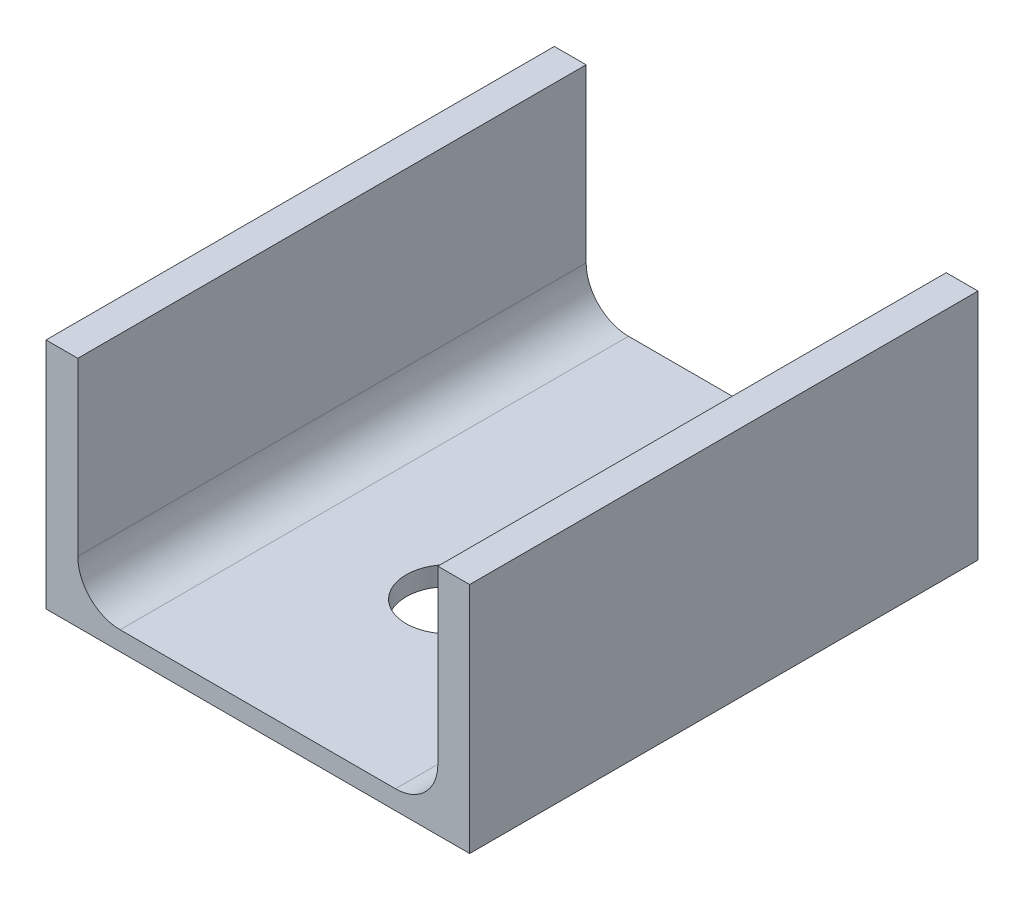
ISO-10303-21;
HEADER;
FILE_DESCRIPTION(('STEP AP214'),'2;1');
FILE_NAME('part.step','',(''),(''),'','','');
FILE_SCHEMA(('AUTOMOTIVE_DESIGN { 1 0 10303 214 1 1 1 1 }'));
ENDSEC;
DATA;
#1=APPLICATION_CONTEXT('core data for automotive mechanical design processes');
#2=APPLICATION_PROTOCOL_DEFINITION('international standard','automotive_design',2000,#1);
#3=PRODUCT_CONTEXT('',#1,'mechanical');
#4=PRODUCT('Part','Part','',(#3));
#5=PRODUCT_RELATED_PRODUCT_CATEGORY('part','',(#4));
#6=PRODUCT_DEFINITION_FORMATION('','',#4);
#7=PRODUCT_DEFINITION_CONTEXT('part definition',#1,'design');
#8=PRODUCT_DEFINITION('design','',#6,#7);
#9=PRODUCT_DEFINITION_SHAPE('','',#8);
#10=(LENGTH_UNIT() NAMED_UNIT(*) SI_UNIT(.MILLI.,.METRE.));
#11=(NAMED_UNIT(*) PLANE_ANGLE_UNIT() SI_UNIT($,.RADIAN.));
#12=(NAMED_UNIT(*) SI_UNIT($,.STERADIAN.) SOLID_ANGLE_UNIT());
#13=UNCERTAINTY_MEASURE_WITH_UNIT(LENGTH_MEASURE(1.E-05),#10,'distance_accuracy_value','');
#14=(GEOMETRIC_REPRESENTATION_CONTEXT(3) GLOBAL_UNCERTAINTY_ASSIGNED_CONTEXT((#13)) GLOBAL_UNIT_ASSIGNED_CONTEXT((#10,
#11,#12)) REPRESENTATION_CONTEXT('',''));
#15=CARTESIAN_POINT('',(0.,0.,0.));
#16=DIRECTION('',(0.,0.,1.));
#17=DIRECTION('',(1.,0.,0.));
#18=AXIS2_PLACEMENT_3D('',#15,#16,#17);
#19=CARTESIAN_POINT('',(0.,0.,120.));
#20=DIRECTION('',(0.,1.,0.));
#21=DIRECTION('',(0.,0.,1.));
#22=AXIS2_PLACEMENT_3D('',#19,#20,#21);
#23=PLANE('',#22);
#24=CARTESIAN_POINT('',(50.,0.,20.));
#25=DIRECTION('',(0.,1.,0.));
#26=DIRECTION('',(0.,0.,1.));
#27=AXIS2_PLACEMENT_3D('',#24,#25,#26);
#28=CIRCLE('',#27,5.);
#29=CARTESIAN_POINT('',(50.,0.,25.));
#30=VERTEX_POINT('',#29);
#31=EDGE_CURVE('E236',#30,#30,#28,.T.);
#32=ORIENTED_EDGE('',*,*,#31,.T.);
#33=EDGE_LOOP('',(#32));
#34=FACE_BOUND('',#33,.T.);
#35=CARTESIAN_POINT('',(50.,0.,75.));
#36=DIRECTION('',(0.,1.,0.));
#37=DIRECTION('',(0.,0.,1.));
#38=AXIS2_PLACEMENT_3D('',#35,#36,#37);
#39=CIRCLE('',#38,9.99999999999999);
#40=CARTESIAN_POINT('',(50.,0.,85.));
#41=VERTEX_POINT('',#40);
#42=EDGE_CURVE('E126',#41,#41,#39,.T.);
#43=ORIENTED_EDGE('',*,*,#42,.T.);
#44=EDGE_LOOP('',(#43));
#45=FACE_BOUND('',#44,.T.);
#46=DIRECTION('',(1.,0.,0.));
#47=VECTOR('',#46,1.);
#48=CARTESIAN_POINT('',(0.,0.,0.));
#49=LINE('',#48,#47);
#50=CARTESIAN_POINT('',(0.,0.,0.));
#51=VERTEX_POINT('',#50);
#52=CARTESIAN_POINT('',(100.,0.,0.));
#53=VERTEX_POINT('',#52);
#54=EDGE_CURVE('E114',#51,#53,#49,.T.);
#55=ORIENTED_EDGE('',*,*,#54,.T.);
#56=DIRECTION('',(0.,0.,-1.));
#57=VECTOR('',#56,1.);
#58=CARTESIAN_POINT('',(100.,0.,120.));
#59=LINE('',#58,#57);
#60=CARTESIAN_POINT('',(100.,0.,120.));
#61=VERTEX_POINT('',#60);
#62=EDGE_CURVE('E11',#61,#53,#59,.T.);
#63=ORIENTED_EDGE('',*,*,#62,.F.);
#64=DIRECTION('',(1.,0.,0.));
#65=VECTOR('',#64,1.);
#66=CARTESIAN_POINT('',(0.,0.,120.));
#67=LINE('',#66,#65);
#68=CARTESIAN_POINT('',(0.,0.,120.));
#69=VERTEX_POINT('',#68);
#70=EDGE_CURVE('E150',#69,#61,#67,.T.);
#71=ORIENTED_EDGE('',*,*,#70,.F.);
#72=DIRECTION('',(0.,0.,-1.));
#73=VECTOR('',#72,1.);
#74=CARTESIAN_POINT('',(0.,0.,120.));
#75=LINE('',#74,#73);
#76=EDGE_CURVE('E46',#69,#51,#75,.T.);
#77=ORIENTED_EDGE('',*,*,#76,.T.);
#78=EDGE_LOOP('',(#55,#63,#71,#77));
#79=FACE_BOUND('',#78,.T.);
#80=ADVANCED_FACE('F32',(#34,#45,#79),#23,.F.);
#81=CARTESIAN_POINT('',(100.,0.,120.));
#82=DIRECTION('',(-1.,0.,0.));
#83=DIRECTION('',(0.,0.,1.));
#84=AXIS2_PLACEMENT_3D('',#81,#82,#83);
#85=PLANE('',#84);
#86=DIRECTION('',(0.,1.,0.));
#87=VECTOR('',#86,1.);
#88=CARTESIAN_POINT('',(100.,0.,0.));
#89=LINE('',#88,#87);
#90=CARTESIAN_POINT('',(100.,55.,0.));
#91=VERTEX_POINT('',#90);
#92=EDGE_CURVE('E110',#53,#91,#89,.T.);
#93=ORIENTED_EDGE('',*,*,#92,.T.);
#94=DIRECTION('',(0.,0.,-1.));
#95=VECTOR('',#94,1.);
#96=CARTESIAN_POINT('',(100.,55.,120.));
#97=LINE('',#96,#95);
#98=CARTESIAN_POINT('',(100.,55.,120.));
#99=VERTEX_POINT('',#98);
#100=EDGE_CURVE('E39',#99,#91,#97,.T.);
#101=ORIENTED_EDGE('',*,*,#100,.F.);
#102=DIRECTION('',(0.,1.,0.));
#103=VECTOR('',#102,1.);
#104=CARTESIAN_POINT('',(100.,0.,120.));
#105=LINE('',#104,#103);
#106=EDGE_CURVE('E123',#61,#99,#105,.T.);
#107=ORIENTED_EDGE('',*,*,#106,.F.);
#108=ORIENTED_EDGE('',*,*,#62,.T.);
#109=EDGE_LOOP('',(#93,#101,#107,#108));
#110=FACE_BOUND('',#109,.T.);
#111=ADVANCED_FACE('F122',(#110),#85,.F.);
#112=CARTESIAN_POINT('',(100.,55.,120.));
#113=DIRECTION('',(0.,-1.,0.));
#114=DIRECTION('',(0.,0.,-1.));
#115=AXIS2_PLACEMENT_3D('',#112,#113,#114);
#116=PLANE('',#115);
#117=DIRECTION('',(-1.,0.,0.));
#118=VECTOR('',#117,1.);
#119=CARTESIAN_POINT('',(100.,55.,0.));
#120=LINE('',#119,#118);
#121=CARTESIAN_POINT('',(92.5,55.,0.));
#122=VERTEX_POINT('',#121);
#123=EDGE_CURVE('E116',#91,#122,#120,.T.);
#124=ORIENTED_EDGE('',*,*,#123,.T.);
#125=DIRECTION('',(0.,0.,-1.));
#126=VECTOR('',#125,1.);
#127=CARTESIAN_POINT('',(92.5,55.,120.));
#128=LINE('',#127,#126);
#129=CARTESIAN_POINT('',(92.5,55.,120.));
#130=VERTEX_POINT('',#129);
#131=EDGE_CURVE('E185',#130,#122,#128,.T.);
#132=ORIENTED_EDGE('',*,*,#131,.F.);
#133=DIRECTION('',(-1.,0.,0.));
#134=VECTOR('',#133,1.);
#135=CARTESIAN_POINT('',(100.,55.,120.));
#136=LINE('',#135,#134);
#137=EDGE_CURVE('E153',#99,#130,#136,.T.);
#138=ORIENTED_EDGE('',*,*,#137,.F.);
#139=ORIENTED_EDGE('',*,*,#100,.T.);
#140=EDGE_LOOP('',(#124,#132,#138,#139));
#141=FACE_BOUND('',#140,.T.);
#142=ADVANCED_FACE('F189',(#141),#116,.F.);
#143=CARTESIAN_POINT('',(92.5,55.,120.));
#144=DIRECTION('',(1.,0.,0.));
#145=DIRECTION('',(0.,0.,-1.));
#146=AXIS2_PLACEMENT_3D('',#143,#144,#145);
#147=PLANE('',#146);
#148=DIRECTION('',(0.,-1.,0.));
#149=VECTOR('',#148,1.);
#150=CARTESIAN_POINT('',(92.5,55.,0.));
#151=LINE('',#150,#149);
#152=CARTESIAN_POINT('',(92.5,14.5000000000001,0.));
#153=VERTEX_POINT('',#152);
#154=EDGE_CURVE('E134',#122,#153,#151,.T.);
#155=ORIENTED_EDGE('',*,*,#154,.T.);
#156=DIRECTION('',(0.,0.,-1.));
#157=VECTOR('',#156,1.);
#158=CARTESIAN_POINT('',(92.5,14.5000000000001,120.));
#159=LINE('',#158,#157);
#160=CARTESIAN_POINT('',(92.5,14.5000000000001,120.));
#161=VERTEX_POINT('',#160);
#162=EDGE_CURVE('E182',#161,#153,#159,.T.);
#163=ORIENTED_EDGE('',*,*,#162,.F.);
#164=DIRECTION('',(0.,-1.,0.));
#165=VECTOR('',#164,1.);
#166=CARTESIAN_POINT('',(92.5,55.,120.));
#167=LINE('',#166,#165);
#168=EDGE_CURVE('E155',#130,#161,#167,.T.);
#169=ORIENTED_EDGE('',*,*,#168,.F.);
#170=ORIENTED_EDGE('',*,*,#131,.T.);
#171=EDGE_LOOP('',(#155,#163,#169,#170));
#172=FACE_BOUND('',#171,.T.);
#173=ADVANCED_FACE('F219',(#172),#147,.F.);
#174=CARTESIAN_POINT('',(82.5,14.5,120.));
#175=DIRECTION('',(0.,0.,-1.));
#176=DIRECTION('',(-1.,0.,0.));
#177=AXIS2_PLACEMENT_3D('',#174,#175,#176);
#178=CYLINDRICAL_SURFACE('',#177,10.);
#179=CARTESIAN_POINT('',(82.5,14.5,0.));
#180=DIRECTION('',(0.,0.,-1.));
#181=DIRECTION('',(-1.,0.,0.));
#182=AXIS2_PLACEMENT_3D('',#179,#180,#181);
#183=CIRCLE('',#182,10.);
#184=CARTESIAN_POINT('',(82.4999999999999,4.5,0.));
#185=VERTEX_POINT('',#184);
#186=EDGE_CURVE('E136',#153,#185,#183,.T.);
#187=ORIENTED_EDGE('',*,*,#186,.T.);
#188=DIRECTION('',(0.,0.,-1.));
#189=VECTOR('',#188,1.);
#190=CARTESIAN_POINT('',(82.4999999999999,4.5,120.));
#191=LINE('',#190,#189);
#192=CARTESIAN_POINT('',(82.4999999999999,4.5,120.));
#193=VERTEX_POINT('',#192);
#194=EDGE_CURVE('E179',#193,#185,#191,.T.);
#195=ORIENTED_EDGE('',*,*,#194,.F.);
#196=CARTESIAN_POINT('',(82.5,14.5,120.));
#197=DIRECTION('',(0.,0.,-1.));
#198=DIRECTION('',(-1.,0.,0.));
#199=AXIS2_PLACEMENT_3D('',#196,#197,#198);
#200=CIRCLE('',#199,10.);
#201=EDGE_CURVE('E157',#161,#193,#200,.T.);
#202=ORIENTED_EDGE('',*,*,#201,.F.);
#203=ORIENTED_EDGE('',*,*,#162,.T.);
#204=EDGE_LOOP('',(#187,#195,#202,#203));
#205=FACE_BOUND('',#204,.T.);
#206=ADVANCED_FACE('F216',(#205),#178,.F.);
#207=CARTESIAN_POINT('',(82.4999999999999,4.5,120.));
#208=DIRECTION('',(0.,-1.,0.));
#209=DIRECTION('',(1.,0.,0.));
#210=AXIS2_PLACEMENT_3D('',#207,#208,#209);
#211=PLANE('',#210);
#212=CARTESIAN_POINT('',(50.,4.49999999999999,20.));
#213=DIRECTION('',(0.,1.,0.));
#214=DIRECTION('',(-1.,0.,0.));
#215=AXIS2_PLACEMENT_3D('',#212,#213,#214);
#216=CIRCLE('',#215,5.);
#217=CARTESIAN_POINT('',(45.,4.49999999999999,20.));
#218=VERTEX_POINT('',#217);
#219=EDGE_CURVE('E270',#218,#218,#216,.T.);
#220=ORIENTED_EDGE('',*,*,#219,.F.);
#221=EDGE_LOOP('',(#220));
#222=FACE_BOUND('',#221,.T.);
#223=CARTESIAN_POINT('',(50.,4.49999999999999,75.));
#224=DIRECTION('',(0.,1.,0.));
#225=DIRECTION('',(-1.,0.,0.));
#226=AXIS2_PLACEMENT_3D('',#223,#224,#225);
#227=CIRCLE('',#226,9.99999999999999);
#228=CARTESIAN_POINT('',(40.,4.49999999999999,75.));
#229=VERTEX_POINT('',#228);
#230=EDGE_CURVE('E129',#229,#229,#227,.T.);
#231=ORIENTED_EDGE('',*,*,#230,.F.);
#232=EDGE_LOOP('',(#231));
#233=FACE_BOUND('',#232,.T.);
#234=DIRECTION('',(-1.,0.,0.));
#235=VECTOR('',#234,1.);
#236=CARTESIAN_POINT('',(82.4999999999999,4.5,0.));
#237=LINE('',#236,#235);
#238=CARTESIAN_POINT('',(17.5000000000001,4.49999999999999,0.));
#239=VERTEX_POINT('',#238);
#240=EDGE_CURVE('E138',#185,#239,#237,.T.);
#241=ORIENTED_EDGE('',*,*,#240,.T.);
#242=DIRECTION('',(0.,0.,-1.));
#243=VECTOR('',#242,1.);
#244=CARTESIAN_POINT('',(17.5000000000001,4.49999999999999,120.));
#245=LINE('',#244,#243);
#246=CARTESIAN_POINT('',(17.5000000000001,4.49999999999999,120.));
#247=VERTEX_POINT('',#246);
#248=EDGE_CURVE('E176',#247,#239,#245,.T.);
#249=ORIENTED_EDGE('',*,*,#248,.F.);
#250=DIRECTION('',(-1.,0.,0.));
#251=VECTOR('',#250,1.);
#252=CARTESIAN_POINT('',(82.4999999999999,4.5,120.));
#253=LINE('',#252,#251);
#254=EDGE_CURVE('E159',#193,#247,#253,.T.);
#255=ORIENTED_EDGE('',*,*,#254,.F.);
#256=ORIENTED_EDGE('',*,*,#194,.T.);
#257=EDGE_LOOP('',(#241,#249,#255,#256));
#258=FACE_BOUND('',#257,.T.);
#259=ADVANCED_FACE('F212',(#222,#233,#258),#211,.F.);
#260=CARTESIAN_POINT('',(17.5,14.5,120.));
#261=DIRECTION('',(0.,0.,-1.));
#262=DIRECTION('',(-1.,0.,0.));
#263=AXIS2_PLACEMENT_3D('',#260,#261,#262);
#264=CYLINDRICAL_SURFACE('',#263,10.);
#265=CARTESIAN_POINT('',(17.5,14.5,0.));
#266=DIRECTION('',(0.,0.,-1.));
#267=DIRECTION('',(-1.,0.,0.));
#268=AXIS2_PLACEMENT_3D('',#265,#266,#267);
#269=CIRCLE('',#268,10.);
#270=CARTESIAN_POINT('',(7.50000000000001,14.5000000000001,0.));
#271=VERTEX_POINT('',#270);
#272=EDGE_CURVE('E140',#239,#271,#269,.T.);
#273=ORIENTED_EDGE('',*,*,#272,.T.);
#274=DIRECTION('',(0.,0.,-1.));
#275=VECTOR('',#274,1.);
#276=CARTESIAN_POINT('',(7.50000000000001,14.5000000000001,120.));
#277=LINE('',#276,#275);
#278=CARTESIAN_POINT('',(7.50000000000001,14.5000000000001,120.));
#279=VERTEX_POINT('',#278);
#280=EDGE_CURVE('E173',#279,#271,#277,.T.);
#281=ORIENTED_EDGE('',*,*,#280,.F.);
#282=CARTESIAN_POINT('',(17.5,14.5,120.));
#283=DIRECTION('',(0.,0.,-1.));
#284=DIRECTION('',(-1.,0.,0.));
#285=AXIS2_PLACEMENT_3D('',#282,#283,#284);
#286=CIRCLE('',#285,10.);
#287=EDGE_CURVE('E161',#247,#279,#286,.T.);
#288=ORIENTED_EDGE('',*,*,#287,.F.);
#289=ORIENTED_EDGE('',*,*,#248,.T.);
#290=EDGE_LOOP('',(#273,#281,#288,#289));
#291=FACE_BOUND('',#290,.T.);
#292=ADVANCED_FACE('F208',(#291),#264,.F.);
#293=CARTESIAN_POINT('',(7.50000000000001,14.5000000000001,120.));
#294=DIRECTION('',(-1.,0.,0.));
#295=DIRECTION('',(0.,-1.,0.));
#296=AXIS2_PLACEMENT_3D('',#293,#294,#295);
#297=PLANE('',#296);
#298=DIRECTION('',(0.,1.,0.));
#299=VECTOR('',#298,1.);
#300=CARTESIAN_POINT('',(7.50000000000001,14.5000000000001,0.));
#301=LINE('',#300,#299);
#302=CARTESIAN_POINT('',(7.5,55.,0.));
#303=VERTEX_POINT('',#302);
#304=EDGE_CURVE('E142',#271,#303,#301,.T.);
#305=ORIENTED_EDGE('',*,*,#304,.T.);
#306=DIRECTION('',(0.,0.,-1.));
#307=VECTOR('',#306,1.);
#308=CARTESIAN_POINT('',(7.5,55.,120.));
#309=LINE('',#308,#307);
#310=CARTESIAN_POINT('',(7.5,55.,120.));
#311=VERTEX_POINT('',#310);
#312=EDGE_CURVE('E171',#311,#303,#309,.T.);
#313=ORIENTED_EDGE('',*,*,#312,.F.);
#314=DIRECTION('',(0.,1.,0.));
#315=VECTOR('',#314,1.);
#316=CARTESIAN_POINT('',(7.50000000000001,14.5000000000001,120.));
#317=LINE('',#316,#315);
#318=EDGE_CURVE('E163',#279,#311,#317,.T.);
#319=ORIENTED_EDGE('',*,*,#318,.F.);
#320=ORIENTED_EDGE('',*,*,#280,.T.);
#321=EDGE_LOOP('',(#305,#313,#319,#320));
#322=FACE_BOUND('',#321,.T.);
#323=ADVANCED_FACE('F203',(#322),#297,.F.);
#324=CARTESIAN_POINT('',(0.,55.,120.));
#325=DIRECTION('',(0.,1.,0.));
#326=DIRECTION('',(0.,0.,1.));
#327=AXIS2_PLACEMENT_3D('',#324,#325,#326);
#328=PLANE('',#327);
#329=DIRECTION('',(1.,0.,0.));
#330=VECTOR('',#329,1.);
#331=CARTESIAN_POINT('',(0.,55.,0.));
#332=LINE('',#331,#330);
#333=CARTESIAN_POINT('',(0.,55.,0.));
#334=VERTEX_POINT('',#333);
#335=EDGE_CURVE('E145',#334,#303,#332,.T.);
#336=ORIENTED_EDGE('',*,*,#335,.F.);
#337=DIRECTION('',(0.,0.,-1.));
#338=VECTOR('',#337,1.);
#339=CARTESIAN_POINT('',(0.,55.,120.));
#340=LINE('',#339,#338);
#341=CARTESIAN_POINT('',(0.,55.,120.));
#342=VERTEX_POINT('',#341);
#343=EDGE_CURVE('E54',#342,#334,#340,.T.);
#344=ORIENTED_EDGE('',*,*,#343,.F.);
#345=DIRECTION('',(1.,0.,0.));
#346=VECTOR('',#345,1.);
#347=CARTESIAN_POINT('',(0.,55.,120.));
#348=LINE('',#347,#346);
#349=EDGE_CURVE('E165',#342,#311,#348,.T.);
#350=ORIENTED_EDGE('',*,*,#349,.T.);
#351=ORIENTED_EDGE('',*,*,#312,.T.);
#352=EDGE_LOOP('',(#336,#344,#350,#351));
#353=FACE_BOUND('',#352,.T.);
#354=ADVANCED_FACE('F197',(#353),#328,.T.);
#355=CARTESIAN_POINT('',(0.,0.,120.));
#356=DIRECTION('',(-1.,0.,0.));
#357=DIRECTION('',(0.,0.,1.));
#358=AXIS2_PLACEMENT_3D('',#355,#356,#357);
#359=PLANE('',#358);
#360=DIRECTION('',(0.,1.,0.));
#361=VECTOR('',#360,1.);
#362=CARTESIAN_POINT('',(0.,0.,0.));
#363=LINE('',#362,#361);
#364=EDGE_CURVE('E148',#51,#334,#363,.T.);
#365=ORIENTED_EDGE('',*,*,#364,.F.);
#366=ORIENTED_EDGE('',*,*,#76,.F.);
#367=DIRECTION('',(0.,1.,0.));
#368=VECTOR('',#367,1.);
#369=CARTESIAN_POINT('',(0.,0.,120.));
#370=LINE('',#369,#368);
#371=EDGE_CURVE('E167',#69,#342,#370,.T.);
#372=ORIENTED_EDGE('',*,*,#371,.T.);
#373=ORIENTED_EDGE('',*,*,#343,.T.);
#374=EDGE_LOOP('',(#365,#366,#372,#373));
#375=FACE_BOUND('',#374,.T.);
#376=ADVANCED_FACE('F196',(#375),#359,.T.);
#377=CARTESIAN_POINT('',(82.5,14.5,120.));
#378=DIRECTION('',(0.,0.,-1.));
#379=DIRECTION('',(-1.,0.,0.));
#380=AXIS2_PLACEMENT_3D('',#377,#378,#379);
#381=PLANE('',#380);
#382=ORIENTED_EDGE('',*,*,#70,.T.);
#383=ORIENTED_EDGE('',*,*,#106,.T.);
#384=ORIENTED_EDGE('',*,*,#137,.T.);
#385=ORIENTED_EDGE('',*,*,#168,.T.);
#386=ORIENTED_EDGE('',*,*,#201,.T.);
#387=ORIENTED_EDGE('',*,*,#254,.T.);
#388=ORIENTED_EDGE('',*,*,#287,.T.);
#389=ORIENTED_EDGE('',*,*,#318,.T.);
#390=ORIENTED_EDGE('',*,*,#349,.F.);
#391=ORIENTED_EDGE('',*,*,#371,.F.);
#392=EDGE_LOOP('',(#382,#383,#384,#385,#386,#387,#388,#389,#390,#391));
#393=FACE_BOUND('',#392,.T.);
#394=ADVANCED_FACE('F193',(#393),#381,.F.);
#395=CARTESIAN_POINT('',(82.5,14.5,0.));
#396=DIRECTION('',(0.,0.,-1.));
#397=DIRECTION('',(-1.,0.,0.));
#398=AXIS2_PLACEMENT_3D('',#395,#396,#397);
#399=PLANE('',#398);
#400=ORIENTED_EDGE('',*,*,#54,.F.);
#401=ORIENTED_EDGE('',*,*,#364,.T.);
#402=ORIENTED_EDGE('',*,*,#335,.T.);
#403=ORIENTED_EDGE('',*,*,#304,.F.);
#404=ORIENTED_EDGE('',*,*,#272,.F.);
#405=ORIENTED_EDGE('',*,*,#240,.F.);
#406=ORIENTED_EDGE('',*,*,#186,.F.);
#407=ORIENTED_EDGE('',*,*,#154,.F.);
#408=ORIENTED_EDGE('',*,*,#123,.F.);
#409=ORIENTED_EDGE('',*,*,#92,.F.);
#410=EDGE_LOOP('',(#400,#401,#402,#403,#404,#405,#406,#407,#408,#409));
#411=FACE_BOUND('',#410,.T.);
#412=ADVANCED_FACE('F111',(#411),#399,.T.);
#413=CARTESIAN_POINT('',(50.,-5.50000000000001,75.));
#414=DIRECTION('',(0.,1.,0.));
#415=DIRECTION('',(-1.,0.,0.));
#416=AXIS2_PLACEMENT_3D('',#413,#414,#415);
#417=CYLINDRICAL_SURFACE('',#416,9.99999999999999);
#418=ORIENTED_EDGE('',*,*,#230,.T.);
#419=EDGE_LOOP('',(#418));
#420=FACE_BOUND('',#419,.T.);
#421=ORIENTED_EDGE('',*,*,#42,.F.);
#422=EDGE_LOOP('',(#421));
#423=FACE_BOUND('',#422,.T.);
#424=ADVANCED_FACE('F239',(#420,#423),#417,.F.);
#425=CARTESIAN_POINT('',(50.,-5.50000000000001,20.));
#426=DIRECTION('',(0.,1.,0.));
#427=DIRECTION('',(-1.,0.,0.));
#428=AXIS2_PLACEMENT_3D('',#425,#426,#427);
#429=CYLINDRICAL_SURFACE('',#428,5.);
#430=ORIENTED_EDGE('',*,*,#219,.T.);
#431=EDGE_LOOP('',(#430));
#432=FACE_BOUND('',#431,.T.);
#433=ORIENTED_EDGE('',*,*,#31,.F.);
#434=EDGE_LOOP('',(#433));
#435=FACE_BOUND('',#434,.T.);
#436=ADVANCED_FACE('F241',(#432,#435),#429,.F.);
#437=CLOSED_SHELL('',(#80,#111,#142,#173,#206,#259,#292,#323,#354,#376,#394,#412,#424,#436));
#438=MANIFOLD_SOLID_BREP('B2',#437);
#439=ADVANCED_BREP_SHAPE_REPRESENTATION('',(#18,#438),#14);
#440=SHAPE_DEFINITION_REPRESENTATION(#9,#439);
ENDSEC;
END-ISO-10303-21;
